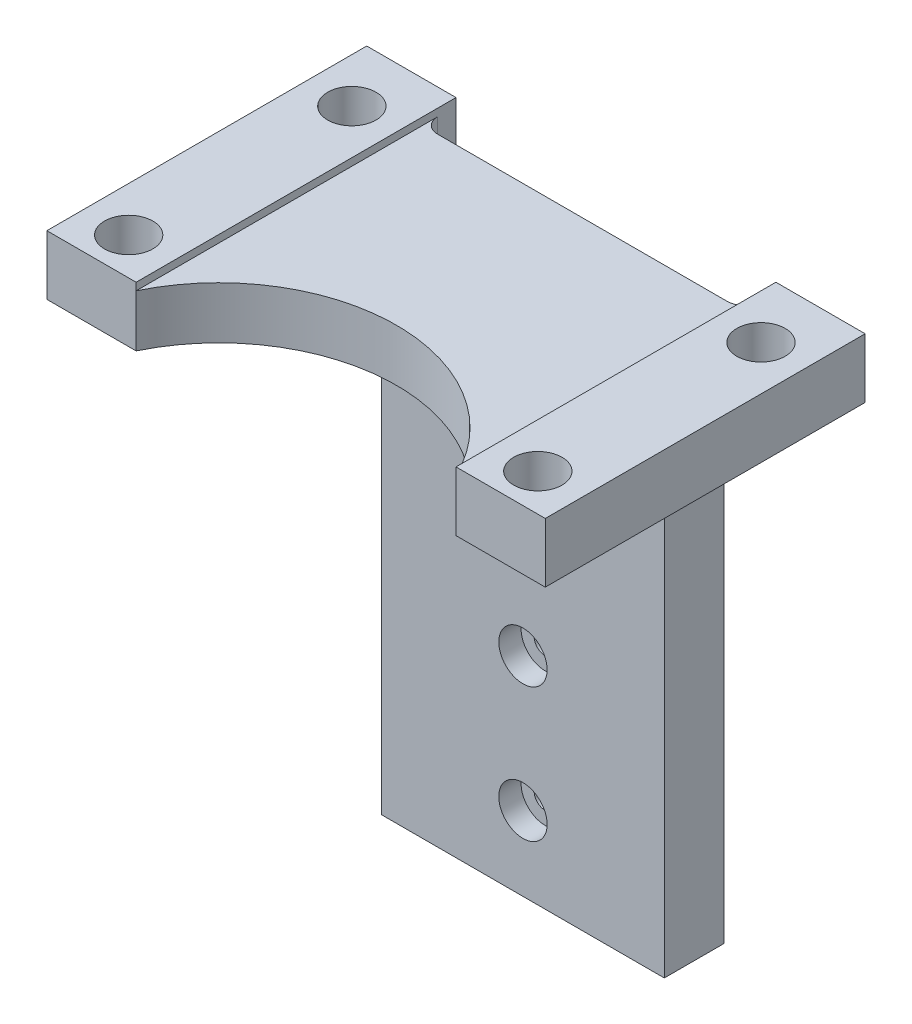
ISO-10303-21;
HEADER;
FILE_DESCRIPTION(('STEP AP214'),'2;1');
FILE_NAME('part.step','',(''),(''),'','','');
FILE_SCHEMA(('AUTOMOTIVE_DESIGN { 1 0 10303 214 1 1 1 1 }'));
ENDSEC;
DATA;
#1=APPLICATION_CONTEXT('core data for automotive mechanical design processes');
#2=APPLICATION_PROTOCOL_DEFINITION('international standard','automotive_design',2000,#1);
#3=PRODUCT_CONTEXT('',#1,'mechanical');
#4=PRODUCT('Part','Part','',(#3));
#5=PRODUCT_RELATED_PRODUCT_CATEGORY('part','',(#4));
#6=PRODUCT_DEFINITION_FORMATION('','',#4);
#7=PRODUCT_DEFINITION_CONTEXT('part definition',#1,'design');
#8=PRODUCT_DEFINITION('design','',#6,#7);
#9=PRODUCT_DEFINITION_SHAPE('','',#8);
#10=(LENGTH_UNIT() NAMED_UNIT(*) SI_UNIT(.MILLI.,.METRE.));
#11=(NAMED_UNIT(*) PLANE_ANGLE_UNIT() SI_UNIT($,.RADIAN.));
#12=(NAMED_UNIT(*) SI_UNIT($,.STERADIAN.) SOLID_ANGLE_UNIT());
#13=UNCERTAINTY_MEASURE_WITH_UNIT(LENGTH_MEASURE(1.E-05),#10,'distance_accuracy_value','');
#14=(GEOMETRIC_REPRESENTATION_CONTEXT(3) GLOBAL_UNCERTAINTY_ASSIGNED_CONTEXT((#13)) GLOBAL_UNIT_ASSIGNED_CONTEXT((#10,
#11,#12)) REPRESENTATION_CONTEXT('',''));
#15=CARTESIAN_POINT('',(0.,0.,0.));
#16=DIRECTION('',(0.,0.,1.));
#17=DIRECTION('',(1.,0.,0.));
#18=AXIS2_PLACEMENT_3D('',#15,#16,#17);
#19=CARTESIAN_POINT('',(14.,8.,-40.5));
#20=DIRECTION('',(0.,1.,0.));
#21=DIRECTION('',(0.,0.,1.));
#22=AXIS2_PLACEMENT_3D('',#19,#20,#21);
#23=PLANE('',#22);
#24=DIRECTION('',(0.,0.,1.));
#25=VECTOR('',#24,1.);
#26=CARTESIAN_POINT('',(55.,8.,-40.5));
#27=LINE('',#26,#25);
#28=CARTESIAN_POINT('',(55.,8.,-43.));
#29=VERTEX_POINT('',#28);
#30=CARTESIAN_POINT('',(55.,8.,0.));
#31=VERTEX_POINT('',#30);
#32=EDGE_CURVE('E158',#29,#31,#27,.T.);
#33=ORIENTED_EDGE('',*,*,#32,.T.);
#34=DIRECTION('',(1.,0.,0.));
#35=VECTOR('',#34,1.);
#36=CARTESIAN_POINT('',(55.,8.,0.));
#37=LINE('',#36,#35);
#38=CARTESIAN_POINT('',(67.,8.,0.));
#39=VERTEX_POINT('',#38);
#40=EDGE_CURVE('E168',#31,#39,#37,.T.);
#41=ORIENTED_EDGE('',*,*,#40,.T.);
#42=DIRECTION('',(0.,0.,-1.));
#43=VECTOR('',#42,1.);
#44=CARTESIAN_POINT('',(67.,8.,0.));
#45=LINE('',#44,#43);
#46=CARTESIAN_POINT('',(67.,8.,-43.));
#47=VERTEX_POINT('',#46);
#48=EDGE_CURVE('E200',#39,#47,#45,.T.);
#49=ORIENTED_EDGE('',*,*,#48,.T.);
#50=DIRECTION('',(-1.,0.,0.));
#51=VECTOR('',#50,1.);
#52=CARTESIAN_POINT('',(55.,8.,-43.));
#53=LINE('',#52,#51);
#54=EDGE_CURVE('E202',#47,#29,#53,.T.);
#55=ORIENTED_EDGE('',*,*,#54,.T.);
#56=EDGE_LOOP('',(#33,#41,#49,#55));
#57=FACE_BOUND('',#56,.T.);
#58=CARTESIAN_POINT('',(61.,8.,-35.));
#59=DIRECTION('',(0.,1.,0.));
#60=DIRECTION('',(0.,0.,1.));
#61=AXIS2_PLACEMENT_3D('',#58,#59,#60);
#62=CIRCLE('',#61,3.25);
#63=CARTESIAN_POINT('',(61.,8.,-31.75));
#64=VERTEX_POINT('',#63);
#65=EDGE_CURVE('E401',#64,#64,#62,.T.);
#66=ORIENTED_EDGE('',*,*,#65,.F.);
#67=EDGE_LOOP('',(#66));
#68=FACE_BOUND('',#67,.T.);
#69=CARTESIAN_POINT('',(61.,8.,-5.));
#70=DIRECTION('',(0.,1.,0.));
#71=DIRECTION('',(0.,0.,1.));
#72=AXIS2_PLACEMENT_3D('',#69,#70,#71);
#73=CIRCLE('',#72,3.25000000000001);
#74=CARTESIAN_POINT('',(61.,8.,-1.74999999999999));
#75=VERTEX_POINT('',#74);
#76=EDGE_CURVE('E393',#75,#75,#73,.T.);
#77=ORIENTED_EDGE('',*,*,#76,.F.);
#78=EDGE_LOOP('',(#77));
#79=FACE_BOUND('',#78,.T.);
#80=ADVANCED_FACE('F26',(#57,#68,#79),#23,.T.);
#81=CARTESIAN_POINT('',(14.,0.,-40.5));
#82=DIRECTION('',(0.,1.,0.));
#83=DIRECTION('',(0.,0.,1.));
#84=AXIS2_PLACEMENT_3D('',#81,#82,#83);
#85=PLANE('',#84);
#86=CARTESIAN_POINT('',(6.,0.,-35.));
#87=DIRECTION('',(0.,1.,0.));
#88=DIRECTION('',(0.,0.,1.));
#89=AXIS2_PLACEMENT_3D('',#86,#87,#88);
#90=CIRCLE('',#89,3.25);
#91=CARTESIAN_POINT('',(6.,0.,-31.75));
#92=VERTEX_POINT('',#91);
#93=EDGE_CURVE('E416',#92,#92,#90,.T.);
#94=ORIENTED_EDGE('',*,*,#93,.T.);
#95=EDGE_LOOP('',(#94));
#96=FACE_BOUND('',#95,.T.);
#97=CARTESIAN_POINT('',(61.,0.,-35.));
#98=DIRECTION('',(0.,1.,0.));
#99=DIRECTION('',(0.,0.,1.));
#100=AXIS2_PLACEMENT_3D('',#97,#98,#99);
#101=CIRCLE('',#100,3.25);
#102=CARTESIAN_POINT('',(61.,0.,-31.75));
#103=VERTEX_POINT('',#102);
#104=EDGE_CURVE('E404',#103,#103,#101,.T.);
#105=ORIENTED_EDGE('',*,*,#104,.T.);
#106=EDGE_LOOP('',(#105));
#107=FACE_BOUND('',#106,.T.);
#108=CARTESIAN_POINT('',(61.,0.,-5.));
#109=DIRECTION('',(0.,1.,0.));
#110=DIRECTION('',(0.,0.,1.));
#111=AXIS2_PLACEMENT_3D('',#108,#109,#110);
#112=CIRCLE('',#111,3.25000000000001);
#113=CARTESIAN_POINT('',(61.,0.,-1.74999999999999));
#114=VERTEX_POINT('',#113);
#115=EDGE_CURVE('E396',#114,#114,#112,.T.);
#116=ORIENTED_EDGE('',*,*,#115,.T.);
#117=EDGE_LOOP('',(#116));
#118=FACE_BOUND('',#117,.T.);
#119=CARTESIAN_POINT('',(6.,0.,-5.));
#120=DIRECTION('',(0.,1.,0.));
#121=DIRECTION('',(0.,0.,1.));
#122=AXIS2_PLACEMENT_3D('',#119,#120,#121);
#123=CIRCLE('',#122,3.25);
#124=CARTESIAN_POINT('',(6.,0.,-1.75));
#125=VERTEX_POINT('',#124);
#126=EDGE_CURVE('E410',#125,#125,#123,.T.);
#127=ORIENTED_EDGE('',*,*,#126,.T.);
#128=EDGE_LOOP('',(#127));
#129=FACE_BOUND('',#128,.T.);
#130=DIRECTION('',(0.,0.,1.));
#131=VECTOR('',#130,1.);
#132=CARTESIAN_POINT('',(52.5,0.,-38.5));
#133=LINE('',#132,#131);
#134=CARTESIAN_POINT('',(52.5,0.,-38.5));
#135=VERTEX_POINT('',#134);
#136=CARTESIAN_POINT('',(52.5,0.,-30.5));
#137=VERTEX_POINT('',#136);
#138=EDGE_CURVE('E330',#135,#137,#133,.T.);
#139=ORIENTED_EDGE('',*,*,#138,.F.);
#140=DIRECTION('',(-1.,0.,0.));
#141=VECTOR('',#140,1.);
#142=CARTESIAN_POINT('',(14.,0.,-38.5));
#143=LINE('',#142,#141);
#144=CARTESIAN_POINT('',(53.,0.,-38.5));
#145=VERTEX_POINT('',#144);
#146=EDGE_CURVE('E179',#145,#135,#143,.T.);
#147=ORIENTED_EDGE('',*,*,#146,.F.);
#148=CARTESIAN_POINT('',(53.,0.,-40.5));
#149=DIRECTION('',(0.,-1.,0.));
#150=DIRECTION('',(0.,0.,1.));
#151=AXIS2_PLACEMENT_3D('',#148,#149,#150);
#152=CIRCLE('',#151,2.);
#153=CARTESIAN_POINT('',(55.,0.,-40.5));
#154=VERTEX_POINT('',#153);
#155=EDGE_CURVE('E189',#154,#145,#152,.T.);
#156=ORIENTED_EDGE('',*,*,#155,.F.);
#157=DIRECTION('',(0.,0.,1.));
#158=VECTOR('',#157,1.);
#159=CARTESIAN_POINT('',(55.,0.,-40.5));
#160=LINE('',#159,#158);
#161=CARTESIAN_POINT('',(55.,0.,-43.));
#162=VERTEX_POINT('',#161);
#163=EDGE_CURVE('E264',#162,#154,#160,.T.);
#164=ORIENTED_EDGE('',*,*,#163,.F.);
#165=DIRECTION('',(-1.,0.,0.));
#166=VECTOR('',#165,1.);
#167=CARTESIAN_POINT('',(55.,0.,-43.));
#168=LINE('',#167,#166);
#169=CARTESIAN_POINT('',(67.,0.,-43.));
#170=VERTEX_POINT('',#169);
#171=EDGE_CURVE('E259',#170,#162,#168,.T.);
#172=ORIENTED_EDGE('',*,*,#171,.F.);
#173=DIRECTION('',(0.,0.,-1.));
#174=VECTOR('',#173,1.);
#175=CARTESIAN_POINT('',(67.,0.,0.));
#176=LINE('',#175,#174);
#177=CARTESIAN_POINT('',(67.,0.,0.));
#178=VERTEX_POINT('',#177);
#179=EDGE_CURVE('E257',#178,#170,#176,.T.);
#180=ORIENTED_EDGE('',*,*,#179,.F.);
#181=DIRECTION('',(1.,0.,0.));
#182=VECTOR('',#181,1.);
#183=CARTESIAN_POINT('',(55.,0.,0.));
#184=LINE('',#183,#182);
#185=CARTESIAN_POINT('',(55.,0.,0.));
#186=VERTEX_POINT('',#185);
#187=EDGE_CURVE('E252',#186,#178,#184,.T.);
#188=ORIENTED_EDGE('',*,*,#187,.F.);
#189=CARTESIAN_POINT('',(33.5,0.,10.3703703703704));
#190=DIRECTION('',(0.,-1.,0.));
#191=DIRECTION('',(0.,0.,-1.));
#192=AXIS2_PLACEMENT_3D('',#189,#190,#191);
#193=CIRCLE('',#192,23.8703703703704);
#194=CARTESIAN_POINT('',(12.,0.,0.));
#195=VERTEX_POINT('',#194);
#196=EDGE_CURVE('E250',#195,#186,#193,.T.);
#197=ORIENTED_EDGE('',*,*,#196,.F.);
#198=DIRECTION('',(1.,0.,0.));
#199=VECTOR('',#198,1.);
#200=CARTESIAN_POINT('',(0.,0.,0.));
#201=LINE('',#200,#199);
#202=CARTESIAN_POINT('',(0.,0.,0.));
#203=VERTEX_POINT('',#202);
#204=EDGE_CURVE('E253',#203,#195,#201,.T.);
#205=ORIENTED_EDGE('',*,*,#204,.F.);
#206=DIRECTION('',(0.,0.,1.));
#207=VECTOR('',#206,1.);
#208=CARTESIAN_POINT('',(0.,0.,0.));
#209=LINE('',#208,#207);
#210=CARTESIAN_POINT('',(0.,0.,-43.));
#211=VERTEX_POINT('',#210);
#212=EDGE_CURVE('E391',#211,#203,#209,.T.);
#213=ORIENTED_EDGE('',*,*,#212,.F.);
#214=DIRECTION('',(-1.,0.,0.));
#215=VECTOR('',#214,1.);
#216=CARTESIAN_POINT('',(0.,0.,-43.));
#217=LINE('',#216,#215);
#218=CARTESIAN_POINT('',(12.,0.,-43.));
#219=VERTEX_POINT('',#218);
#220=EDGE_CURVE('E196',#219,#211,#217,.T.);
#221=ORIENTED_EDGE('',*,*,#220,.F.);
#222=DIRECTION('',(0.,0.,-1.));
#223=VECTOR('',#222,1.);
#224=CARTESIAN_POINT('',(12.,0.,-43.));
#225=LINE('',#224,#223);
#226=CARTESIAN_POINT('',(12.,0.,-40.5));
#227=VERTEX_POINT('',#226);
#228=EDGE_CURVE('E194',#227,#219,#225,.T.);
#229=ORIENTED_EDGE('',*,*,#228,.F.);
#230=CARTESIAN_POINT('',(14.,0.,-40.5));
#231=DIRECTION('',(0.,-1.,0.));
#232=DIRECTION('',(0.,0.,1.));
#233=AXIS2_PLACEMENT_3D('',#230,#231,#232);
#234=CIRCLE('',#233,2.);
#235=CARTESIAN_POINT('',(14.,0.,-38.5));
#236=VERTEX_POINT('',#235);
#237=EDGE_CURVE('E183',#236,#227,#234,.T.);
#238=ORIENTED_EDGE('',*,*,#237,.F.);
#239=CARTESIAN_POINT('',(14.5,0.,-38.5));
#240=VERTEX_POINT('',#239);
#241=EDGE_CURVE('E184',#240,#236,#143,.T.);
#242=ORIENTED_EDGE('',*,*,#241,.F.);
#243=DIRECTION('',(0.,0.,-1.));
#244=VECTOR('',#243,1.);
#245=CARTESIAN_POINT('',(14.5,0.,-38.5));
#246=LINE('',#245,#244);
#247=CARTESIAN_POINT('',(14.5,0.,-30.5));
#248=VERTEX_POINT('',#247);
#249=EDGE_CURVE('E332',#248,#240,#246,.T.);
#250=ORIENTED_EDGE('',*,*,#249,.F.);
#251=DIRECTION('',(-1.,0.,0.));
#252=VECTOR('',#251,1.);
#253=CARTESIAN_POINT('',(52.5,0.,-30.5));
#254=LINE('',#253,#252);
#255=EDGE_CURVE('E51',#137,#248,#254,.T.);
#256=ORIENTED_EDGE('',*,*,#255,.F.);
#257=EDGE_LOOP('',(#139,#147,#156,#164,#172,#180,#188,#197,#205,#213,#221,#229,#238,#242,#250,#256));
#258=FACE_BOUND('',#257,.T.);
#259=ADVANCED_FACE('F255',(#96,#107,#118,#129,#258),#85,.F.);
#260=DIRECTION('',(1.,0.,0.));
#261=VECTOR('',#260,1.);
#262=CARTESIAN_POINT('',(0.,8.,0.));
#263=LINE('',#262,#261);
#264=CARTESIAN_POINT('',(0.,8.,0.));
#265=VERTEX_POINT('',#264);
#266=CARTESIAN_POINT('',(12.,8.,0.));
#267=VERTEX_POINT('',#266);
#268=EDGE_CURVE('E161',#265,#267,#263,.T.);
#269=ORIENTED_EDGE('',*,*,#268,.T.);
#270=DIRECTION('',(0.,0.,-1.));
#271=VECTOR('',#270,1.);
#272=CARTESIAN_POINT('',(12.,8.,-43.));
#273=LINE('',#272,#271);
#274=CARTESIAN_POINT('',(12.,8.,-43.));
#275=VERTEX_POINT('',#274);
#276=EDGE_CURVE('E147',#267,#275,#273,.T.);
#277=ORIENTED_EDGE('',*,*,#276,.T.);
#278=DIRECTION('',(-1.,0.,0.));
#279=VECTOR('',#278,1.);
#280=CARTESIAN_POINT('',(0.,8.,-43.));
#281=LINE('',#280,#279);
#282=CARTESIAN_POINT('',(0.,8.,-43.));
#283=VERTEX_POINT('',#282);
#284=EDGE_CURVE('E157',#275,#283,#281,.T.);
#285=ORIENTED_EDGE('',*,*,#284,.T.);
#286=DIRECTION('',(0.,0.,1.));
#287=VECTOR('',#286,1.);
#288=CARTESIAN_POINT('',(0.,8.,0.));
#289=LINE('',#288,#287);
#290=EDGE_CURVE('E165',#283,#265,#289,.T.);
#291=ORIENTED_EDGE('',*,*,#290,.T.);
#292=EDGE_LOOP('',(#269,#277,#285,#291));
#293=FACE_BOUND('',#292,.T.);
#294=CARTESIAN_POINT('',(6.,8.,-5.));
#295=DIRECTION('',(0.,1.,0.));
#296=DIRECTION('',(0.,0.,1.));
#297=AXIS2_PLACEMENT_3D('',#294,#295,#296);
#298=CIRCLE('',#297,3.25);
#299=CARTESIAN_POINT('',(6.,8.,-1.75));
#300=VERTEX_POINT('',#299);
#301=EDGE_CURVE('E407',#300,#300,#298,.T.);
#302=ORIENTED_EDGE('',*,*,#301,.F.);
#303=EDGE_LOOP('',(#302));
#304=FACE_BOUND('',#303,.T.);
#305=CARTESIAN_POINT('',(6.,8.,-35.));
#306=DIRECTION('',(0.,1.,0.));
#307=DIRECTION('',(0.,0.,1.));
#308=AXIS2_PLACEMENT_3D('',#305,#306,#307);
#309=CIRCLE('',#308,3.25);
#310=CARTESIAN_POINT('',(6.,8.,-31.75));
#311=VERTEX_POINT('',#310);
#312=EDGE_CURVE('E413',#311,#311,#309,.T.);
#313=ORIENTED_EDGE('',*,*,#312,.F.);
#314=EDGE_LOOP('',(#313));
#315=FACE_BOUND('',#314,.T.);
#316=ADVANCED_FACE('F162',(#293,#304,#315),#23,.T.);
#317=CARTESIAN_POINT('',(0.,8.,0.));
#318=DIRECTION('',(1.,0.,0.));
#319=DIRECTION('',(0.,0.,-1.));
#320=AXIS2_PLACEMENT_3D('',#317,#318,#319);
#321=PLANE('',#320);
#322=ORIENTED_EDGE('',*,*,#212,.T.);
#323=DIRECTION('',(0.,-1.,0.));
#324=VECTOR('',#323,1.);
#325=CARTESIAN_POINT('',(0.,8.,0.));
#326=LINE('',#325,#324);
#327=EDGE_CURVE('E11',#265,#203,#326,.T.);
#328=ORIENTED_EDGE('',*,*,#327,.F.);
#329=ORIENTED_EDGE('',*,*,#290,.F.);
#330=DIRECTION('',(0.,-1.,0.));
#331=VECTOR('',#330,1.);
#332=CARTESIAN_POINT('',(0.,8.,-43.));
#333=LINE('',#332,#331);
#334=EDGE_CURVE('E206',#283,#211,#333,.T.);
#335=ORIENTED_EDGE('',*,*,#334,.T.);
#336=EDGE_LOOP('',(#322,#328,#329,#335));
#337=FACE_BOUND('',#336,.T.);
#338=ADVANCED_FACE('F28',(#337),#321,.F.);
#339=CARTESIAN_POINT('',(0.,8.,0.));
#340=DIRECTION('',(0.,0.,-1.));
#341=DIRECTION('',(-1.,0.,0.));
#342=AXIS2_PLACEMENT_3D('',#339,#340,#341);
#343=PLANE('',#342);
#344=ORIENTED_EDGE('',*,*,#204,.T.);
#345=DIRECTION('',(0.,-1.,0.));
#346=VECTOR('',#345,1.);
#347=CARTESIAN_POINT('',(12.,8.,0.));
#348=LINE('',#347,#346);
#349=CARTESIAN_POINT('',(12.,7.,0.));
#350=VERTEX_POINT('',#349);
#351=EDGE_CURVE('E173',#350,#195,#348,.T.);
#352=ORIENTED_EDGE('',*,*,#351,.F.);
#353=EDGE_CURVE('E35',#267,#350,#348,.T.);
#354=ORIENTED_EDGE('',*,*,#353,.F.);
#355=ORIENTED_EDGE('',*,*,#268,.F.);
#356=ORIENTED_EDGE('',*,*,#327,.T.);
#357=EDGE_LOOP('',(#344,#352,#354,#355,#356));
#358=FACE_BOUND('',#357,.T.);
#359=ADVANCED_FACE('F172',(#358),#343,.F.);
#360=CARTESIAN_POINT('',(33.5,8.,10.3703703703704));
#361=DIRECTION('',(0.,-1.,0.));
#362=DIRECTION('',(0.,0.,-1.));
#363=AXIS2_PLACEMENT_3D('',#360,#361,#362);
#364=CYLINDRICAL_SURFACE('',#363,23.8703703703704);
#365=DIRECTION('',(0.,-1.,0.));
#366=VECTOR('',#365,1.);
#367=CARTESIAN_POINT('',(55.,8.,0.));
#368=LINE('',#367,#366);
#369=CARTESIAN_POINT('',(55.,7.,0.));
#370=VERTEX_POINT('',#369);
#371=EDGE_CURVE('E224',#370,#186,#368,.T.);
#372=ORIENTED_EDGE('',*,*,#371,.F.);
#373=CARTESIAN_POINT('',(33.5,7.,10.3703703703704));
#374=DIRECTION('',(0.,-1.,0.));
#375=DIRECTION('',(0.,0.,-1.));
#376=AXIS2_PLACEMENT_3D('',#373,#374,#375);
#377=CIRCLE('',#376,23.8703703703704);
#378=EDGE_CURVE('E248',#370,#350,#377,.F.);
#379=ORIENTED_EDGE('',*,*,#378,.T.);
#380=ORIENTED_EDGE('',*,*,#351,.T.);
#381=ORIENTED_EDGE('',*,*,#196,.T.);
#382=EDGE_LOOP('',(#372,#379,#380,#381));
#383=FACE_BOUND('',#382,.T.);
#384=ADVANCED_FACE('F247',(#383),#364,.F.);
#385=CARTESIAN_POINT('',(55.,8.,0.));
#386=DIRECTION('',(0.,0.,-1.));
#387=DIRECTION('',(-1.,0.,0.));
#388=AXIS2_PLACEMENT_3D('',#385,#386,#387);
#389=PLANE('',#388);
#390=ORIENTED_EDGE('',*,*,#187,.T.);
#391=DIRECTION('',(0.,-1.,0.));
#392=VECTOR('',#391,1.);
#393=CARTESIAN_POINT('',(67.,8.,0.));
#394=LINE('',#393,#392);
#395=EDGE_CURVE('E222',#39,#178,#394,.T.);
#396=ORIENTED_EDGE('',*,*,#395,.F.);
#397=ORIENTED_EDGE('',*,*,#40,.F.);
#398=EDGE_CURVE('E175',#31,#370,#368,.T.);
#399=ORIENTED_EDGE('',*,*,#398,.T.);
#400=ORIENTED_EDGE('',*,*,#371,.T.);
#401=EDGE_LOOP('',(#390,#396,#397,#399,#400));
#402=FACE_BOUND('',#401,.T.);
#403=ADVANCED_FACE('F235',(#402),#389,.F.);
#404=CARTESIAN_POINT('',(67.,8.,0.));
#405=DIRECTION('',(-1.,0.,0.));
#406=DIRECTION('',(0.,0.,1.));
#407=AXIS2_PLACEMENT_3D('',#404,#405,#406);
#408=PLANE('',#407);
#409=ORIENTED_EDGE('',*,*,#179,.T.);
#410=DIRECTION('',(0.,-1.,0.));
#411=VECTOR('',#410,1.);
#412=CARTESIAN_POINT('',(67.,8.,-43.));
#413=LINE('',#412,#411);
#414=EDGE_CURVE('E220',#47,#170,#413,.T.);
#415=ORIENTED_EDGE('',*,*,#414,.F.);
#416=ORIENTED_EDGE('',*,*,#48,.F.);
#417=ORIENTED_EDGE('',*,*,#395,.T.);
#418=EDGE_LOOP('',(#409,#415,#416,#417));
#419=FACE_BOUND('',#418,.T.);
#420=ADVANCED_FACE('F489',(#419),#408,.F.);
#421=CARTESIAN_POINT('',(55.,8.,-43.));
#422=DIRECTION('',(0.,0.,1.));
#423=DIRECTION('',(1.,0.,0.));
#424=AXIS2_PLACEMENT_3D('',#421,#422,#423);
#425=PLANE('',#424);
#426=ORIENTED_EDGE('',*,*,#171,.T.);
#427=DIRECTION('',(0.,-1.,0.));
#428=VECTOR('',#427,1.);
#429=CARTESIAN_POINT('',(55.,8.,-43.));
#430=LINE('',#429,#428);
#431=EDGE_CURVE('E218',#29,#162,#430,.T.);
#432=ORIENTED_EDGE('',*,*,#431,.F.);
#433=ORIENTED_EDGE('',*,*,#54,.F.);
#434=ORIENTED_EDGE('',*,*,#414,.T.);
#435=EDGE_LOOP('',(#426,#432,#433,#434));
#436=FACE_BOUND('',#435,.T.);
#437=ADVANCED_FACE('F486',(#436),#425,.F.);
#438=CARTESIAN_POINT('',(55.,8.,-40.5));
#439=DIRECTION('',(1.,0.,0.));
#440=DIRECTION('',(0.,0.,-1.));
#441=AXIS2_PLACEMENT_3D('',#438,#439,#440);
#442=PLANE('',#441);
#443=DIRECTION('',(0.,-1.,0.));
#444=VECTOR('',#443,1.);
#445=CARTESIAN_POINT('',(55.,8.,-40.5));
#446=LINE('',#445,#444);
#447=CARTESIAN_POINT('',(55.,7.,-40.5));
#448=VERTEX_POINT('',#447);
#449=EDGE_CURVE('E216',#448,#154,#446,.T.);
#450=ORIENTED_EDGE('',*,*,#449,.F.);
#451=DIRECTION('',(0.,0.,-1.));
#452=VECTOR('',#451,1.);
#453=CARTESIAN_POINT('',(55.,7.,-43.));
#454=LINE('',#453,#452);
#455=EDGE_CURVE('E241',#370,#448,#454,.T.);
#456=ORIENTED_EDGE('',*,*,#455,.F.);
#457=ORIENTED_EDGE('',*,*,#398,.F.);
#458=ORIENTED_EDGE('',*,*,#32,.F.);
#459=ORIENTED_EDGE('',*,*,#431,.T.);
#460=ORIENTED_EDGE('',*,*,#163,.T.);
#461=EDGE_LOOP('',(#450,#456,#457,#458,#459,#460));
#462=FACE_BOUND('',#461,.T.);
#463=ADVANCED_FACE('F240',(#462),#442,.F.);
#464=CARTESIAN_POINT('',(53.,8.,-40.5));
#465=DIRECTION('',(0.,-1.,0.));
#466=DIRECTION('',(0.,0.,-1.));
#467=AXIS2_PLACEMENT_3D('',#464,#465,#466);
#468=CYLINDRICAL_SURFACE('',#467,2.);
#469=DIRECTION('',(0.,-1.,0.));
#470=VECTOR('',#469,1.);
#471=CARTESIAN_POINT('',(53.,8.,-38.5));
#472=LINE('',#471,#470);
#473=CARTESIAN_POINT('',(53.,7.,-38.5));
#474=VERTEX_POINT('',#473);
#475=EDGE_CURVE('E214',#474,#145,#472,.T.);
#476=ORIENTED_EDGE('',*,*,#475,.F.);
#477=CARTESIAN_POINT('',(53.,7.,-40.5));
#478=DIRECTION('',(0.,-1.,0.));
#479=DIRECTION('',(0.,0.,-1.));
#480=AXIS2_PLACEMENT_3D('',#477,#478,#479);
#481=CIRCLE('',#480,2.);
#482=EDGE_CURVE('E288',#474,#448,#481,.F.);
#483=ORIENTED_EDGE('',*,*,#482,.T.);
#484=ORIENTED_EDGE('',*,*,#449,.T.);
#485=ORIENTED_EDGE('',*,*,#155,.T.);
#486=EDGE_LOOP('',(#476,#483,#484,#485));
#487=FACE_BOUND('',#486,.T.);
#488=ADVANCED_FACE('F358',(#487),#468,.F.);
#489=CARTESIAN_POINT('',(14.,8.,-38.5));
#490=DIRECTION('',(0.,0.,1.));
#491=DIRECTION('',(1.,0.,0.));
#492=AXIS2_PLACEMENT_3D('',#489,#490,#491);
#493=PLANE('',#492);
#494=CARTESIAN_POINT('',(33.4999999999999,-22.,-38.5));
#495=DIRECTION('',(0.,0.,1.));
#496=DIRECTION('',(1.,0.,0.));
#497=AXIS2_PLACEMENT_3D('',#494,#495,#496);
#498=CIRCLE('',#497,1.5);
#499=CARTESIAN_POINT('',(34.9999999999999,-22.,-38.5));
#500=VERTEX_POINT('',#499);
#501=EDGE_CURVE('E297',#500,#500,#498,.T.);
#502=ORIENTED_EDGE('',*,*,#501,.T.);
#503=EDGE_LOOP('',(#502));
#504=FACE_BOUND('',#503,.T.);
#505=CARTESIAN_POINT('',(33.4999999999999,-40.,-38.5));
#506=DIRECTION('',(0.,0.,1.));
#507=DIRECTION('',(1.,0.,0.));
#508=AXIS2_PLACEMENT_3D('',#505,#506,#507);
#509=CIRCLE('',#508,1.5);
#510=CARTESIAN_POINT('',(34.9999999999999,-40.,-38.5));
#511=VERTEX_POINT('',#510);
#512=EDGE_CURVE('E303',#511,#511,#509,.T.);
#513=ORIENTED_EDGE('',*,*,#512,.T.);
#514=EDGE_LOOP('',(#513));
#515=FACE_BOUND('',#514,.T.);
#516=CARTESIAN_POINT('',(33.5,-58.,-38.5));
#517=DIRECTION('',(0.,0.,1.));
#518=DIRECTION('',(1.,0.,0.));
#519=AXIS2_PLACEMENT_3D('',#516,#517,#518);
#520=CIRCLE('',#519,1.5);
#521=CARTESIAN_POINT('',(35.,-58.,-38.5));
#522=VERTEX_POINT('',#521);
#523=EDGE_CURVE('E309',#522,#522,#520,.T.);
#524=ORIENTED_EDGE('',*,*,#523,.T.);
#525=EDGE_LOOP('',(#524));
#526=FACE_BOUND('',#525,.T.);
#527=DIRECTION('',(0.,-1.,0.));
#528=VECTOR('',#527,1.);
#529=CARTESIAN_POINT('',(14.,8.,-38.5));
#530=LINE('',#529,#528);
#531=CARTESIAN_POINT('',(14.,7.,-38.5));
#532=VERTEX_POINT('',#531);
#533=EDGE_CURVE('E212',#532,#236,#530,.T.);
#534=ORIENTED_EDGE('',*,*,#533,.F.);
#535=DIRECTION('',(1.,0.,0.));
#536=VECTOR('',#535,1.);
#537=CARTESIAN_POINT('',(14.,7.,-38.5));
#538=LINE('',#537,#536);
#539=EDGE_CURVE('E43',#532,#474,#538,.T.);
#540=ORIENTED_EDGE('',*,*,#539,.T.);
#541=ORIENTED_EDGE('',*,*,#475,.T.);
#542=ORIENTED_EDGE('',*,*,#146,.T.);
#543=DIRECTION('',(0.,1.,0.));
#544=VECTOR('',#543,1.);
#545=CARTESIAN_POINT('',(52.5,-68.,-38.5));
#546=LINE('',#545,#544);
#547=CARTESIAN_POINT('',(52.5,-68.,-38.5));
#548=VERTEX_POINT('',#547);
#549=EDGE_CURVE('E342',#548,#135,#546,.T.);
#550=ORIENTED_EDGE('',*,*,#549,.F.);
#551=DIRECTION('',(1.,0.,0.));
#552=VECTOR('',#551,1.);
#553=CARTESIAN_POINT('',(52.5,-68.,-38.5));
#554=LINE('',#553,#552);
#555=CARTESIAN_POINT('',(14.5,-68.,-38.5));
#556=VERTEX_POINT('',#555);
#557=EDGE_CURVE('E347',#556,#548,#554,.T.);
#558=ORIENTED_EDGE('',*,*,#557,.F.);
#559=DIRECTION('',(0.,1.,0.));
#560=VECTOR('',#559,1.);
#561=CARTESIAN_POINT('',(14.5,-68.,-38.5));
#562=LINE('',#561,#560);
#563=EDGE_CURVE('E279',#556,#240,#562,.T.);
#564=ORIENTED_EDGE('',*,*,#563,.T.);
#565=ORIENTED_EDGE('',*,*,#241,.T.);
#566=EDGE_LOOP('',(#534,#540,#541,#542,#550,#558,#564,#565));
#567=FACE_BOUND('',#566,.T.);
#568=ADVANCED_FACE('F276',(#504,#515,#526,#567),#493,.F.);
#569=CARTESIAN_POINT('',(14.,8.,-40.5));
#570=DIRECTION('',(0.,-1.,0.));
#571=DIRECTION('',(0.,0.,-1.));
#572=AXIS2_PLACEMENT_3D('',#569,#570,#571);
#573=CYLINDRICAL_SURFACE('',#572,2.);
#574=DIRECTION('',(0.,-1.,0.));
#575=VECTOR('',#574,1.);
#576=CARTESIAN_POINT('',(12.,8.,-40.5));
#577=LINE('',#576,#575);
#578=CARTESIAN_POINT('',(12.,7.,-40.5));
#579=VERTEX_POINT('',#578);
#580=EDGE_CURVE('E210',#579,#227,#577,.T.);
#581=ORIENTED_EDGE('',*,*,#580,.F.);
#582=CARTESIAN_POINT('',(14.,7.,-40.5));
#583=DIRECTION('',(0.,-1.,0.));
#584=DIRECTION('',(0.,0.,-1.));
#585=AXIS2_PLACEMENT_3D('',#582,#583,#584);
#586=CIRCLE('',#585,2.);
#587=EDGE_CURVE('E286',#579,#532,#586,.F.);
#588=ORIENTED_EDGE('',*,*,#587,.T.);
#589=ORIENTED_EDGE('',*,*,#533,.T.);
#590=ORIENTED_EDGE('',*,*,#237,.T.);
#591=EDGE_LOOP('',(#581,#588,#589,#590));
#592=FACE_BOUND('',#591,.T.);
#593=ADVANCED_FACE('F285',(#592),#573,.F.);
#594=CARTESIAN_POINT('',(12.,8.,-43.));
#595=DIRECTION('',(-1.,0.,0.));
#596=DIRECTION('',(0.,0.,1.));
#597=AXIS2_PLACEMENT_3D('',#594,#595,#596);
#598=PLANE('',#597);
#599=ORIENTED_EDGE('',*,*,#228,.T.);
#600=DIRECTION('',(0.,-1.,0.));
#601=VECTOR('',#600,1.);
#602=CARTESIAN_POINT('',(12.,8.,-43.));
#603=LINE('',#602,#601);
#604=EDGE_CURVE('E154',#275,#219,#603,.T.);
#605=ORIENTED_EDGE('',*,*,#604,.F.);
#606=ORIENTED_EDGE('',*,*,#276,.F.);
#607=ORIENTED_EDGE('',*,*,#353,.T.);
#608=DIRECTION('',(0.,0.,1.));
#609=VECTOR('',#608,1.);
#610=CARTESIAN_POINT('',(12.,7.,-43.));
#611=LINE('',#610,#609);
#612=EDGE_CURVE('E244',#579,#350,#611,.T.);
#613=ORIENTED_EDGE('',*,*,#612,.F.);
#614=ORIENTED_EDGE('',*,*,#580,.T.);
#615=EDGE_LOOP('',(#599,#605,#606,#607,#613,#614));
#616=FACE_BOUND('',#615,.T.);
#617=ADVANCED_FACE('F150',(#616),#598,.F.);
#618=CARTESIAN_POINT('',(0.,8.,-43.));
#619=DIRECTION('',(0.,0.,1.));
#620=DIRECTION('',(1.,0.,0.));
#621=AXIS2_PLACEMENT_3D('',#618,#619,#620);
#622=PLANE('',#621);
#623=ORIENTED_EDGE('',*,*,#220,.T.);
#624=ORIENTED_EDGE('',*,*,#334,.F.);
#625=ORIENTED_EDGE('',*,*,#284,.F.);
#626=ORIENTED_EDGE('',*,*,#604,.T.);
#627=EDGE_LOOP('',(#623,#624,#625,#626));
#628=FACE_BOUND('',#627,.T.);
#629=ADVANCED_FACE('F459',(#628),#622,.F.);
#630=CARTESIAN_POINT('',(61.,8.,-5.));
#631=DIRECTION('',(0.,-1.,0.));
#632=DIRECTION('',(0.,0.,-1.));
#633=AXIS2_PLACEMENT_3D('',#630,#631,#632);
#634=CYLINDRICAL_SURFACE('',#633,3.25000000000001);
#635=ORIENTED_EDGE('',*,*,#76,.T.);
#636=EDGE_LOOP('',(#635));
#637=FACE_BOUND('',#636,.T.);
#638=ORIENTED_EDGE('',*,*,#115,.F.);
#639=EDGE_LOOP('',(#638));
#640=FACE_BOUND('',#639,.T.);
#641=ADVANCED_FACE('F456',(#637,#640),#634,.F.);
#642=CARTESIAN_POINT('',(61.,8.,-35.));
#643=DIRECTION('',(0.,-1.,0.));
#644=DIRECTION('',(0.,0.,-1.));
#645=AXIS2_PLACEMENT_3D('',#642,#643,#644);
#646=CYLINDRICAL_SURFACE('',#645,3.25);
#647=ORIENTED_EDGE('',*,*,#65,.T.);
#648=EDGE_LOOP('',(#647));
#649=FACE_BOUND('',#648,.T.);
#650=ORIENTED_EDGE('',*,*,#104,.F.);
#651=EDGE_LOOP('',(#650));
#652=FACE_BOUND('',#651,.T.);
#653=ADVANCED_FACE('F452',(#649,#652),#646,.F.);
#654=CARTESIAN_POINT('',(6.,8.,-5.));
#655=DIRECTION('',(0.,-1.,0.));
#656=DIRECTION('',(0.,0.,-1.));
#657=AXIS2_PLACEMENT_3D('',#654,#655,#656);
#658=CYLINDRICAL_SURFACE('',#657,3.25);
#659=ORIENTED_EDGE('',*,*,#301,.T.);
#660=EDGE_LOOP('',(#659));
#661=FACE_BOUND('',#660,.T.);
#662=ORIENTED_EDGE('',*,*,#126,.F.);
#663=EDGE_LOOP('',(#662));
#664=FACE_BOUND('',#663,.T.);
#665=ADVANCED_FACE('F448',(#661,#664),#658,.F.);
#666=CARTESIAN_POINT('',(6.,8.,-35.));
#667=DIRECTION('',(0.,-1.,0.));
#668=DIRECTION('',(0.,0.,-1.));
#669=AXIS2_PLACEMENT_3D('',#666,#667,#668);
#670=CYLINDRICAL_SURFACE('',#669,3.25);
#671=ORIENTED_EDGE('',*,*,#312,.T.);
#672=EDGE_LOOP('',(#671));
#673=FACE_BOUND('',#672,.T.);
#674=ORIENTED_EDGE('',*,*,#93,.F.);
#675=EDGE_LOOP('',(#674));
#676=FACE_BOUND('',#675,.T.);
#677=ADVANCED_FACE('F440',(#673,#676),#670,.F.);
#678=CARTESIAN_POINT('',(52.5,-68.,-38.5));
#679=DIRECTION('',(-1.,0.,0.));
#680=DIRECTION('',(0.,0.,1.));
#681=AXIS2_PLACEMENT_3D('',#678,#679,#680);
#682=PLANE('',#681);
#683=ORIENTED_EDGE('',*,*,#138,.T.);
#684=DIRECTION('',(0.,1.,0.));
#685=VECTOR('',#684,1.);
#686=CARTESIAN_POINT('',(52.5,-68.,-30.5));
#687=LINE('',#686,#685);
#688=CARTESIAN_POINT('',(52.5,-68.,-30.5));
#689=VERTEX_POINT('',#688);
#690=EDGE_CURVE('E344',#689,#137,#687,.T.);
#691=ORIENTED_EDGE('',*,*,#690,.F.);
#692=DIRECTION('',(0.,0.,1.));
#693=VECTOR('',#692,1.);
#694=CARTESIAN_POINT('',(52.5,-68.,-38.5));
#695=LINE('',#694,#693);
#696=EDGE_CURVE('E335',#548,#689,#695,.T.);
#697=ORIENTED_EDGE('',*,*,#696,.F.);
#698=ORIENTED_EDGE('',*,*,#549,.T.);
#699=EDGE_LOOP('',(#683,#691,#697,#698));
#700=FACE_BOUND('',#699,.T.);
#701=ADVANCED_FACE('F357',(#700),#682,.F.);
#702=CARTESIAN_POINT('',(52.5,-68.,-30.5));
#703=DIRECTION('',(0.,0.,-1.));
#704=DIRECTION('',(-1.,0.,0.));
#705=AXIS2_PLACEMENT_3D('',#702,#703,#704);
#706=PLANE('',#705);
#707=CARTESIAN_POINT('',(33.4999999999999,-22.,-30.5));
#708=DIRECTION('',(0.,0.,1.));
#709=DIRECTION('',(1.,0.,0.));
#710=AXIS2_PLACEMENT_3D('',#707,#708,#709);
#711=CIRCLE('',#710,3.25);
#712=CARTESIAN_POINT('',(36.7499999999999,-22.,-30.5));
#713=VERTEX_POINT('',#712);
#714=EDGE_CURVE('E312',#713,#713,#711,.T.);
#715=ORIENTED_EDGE('',*,*,#714,.F.);
#716=EDGE_LOOP('',(#715));
#717=FACE_BOUND('',#716,.T.);
#718=CARTESIAN_POINT('',(33.4999999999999,-40.,-30.5));
#719=DIRECTION('',(0.,0.,1.));
#720=DIRECTION('',(1.,0.,0.));
#721=AXIS2_PLACEMENT_3D('',#718,#719,#720);
#722=CIRCLE('',#721,3.25);
#723=CARTESIAN_POINT('',(36.7499999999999,-40.,-30.5));
#724=VERTEX_POINT('',#723);
#725=EDGE_CURVE('E318',#724,#724,#722,.T.);
#726=ORIENTED_EDGE('',*,*,#725,.F.);
#727=EDGE_LOOP('',(#726));
#728=FACE_BOUND('',#727,.T.);
#729=CARTESIAN_POINT('',(33.5,-58.,-30.5));
#730=DIRECTION('',(0.,0.,1.));
#731=DIRECTION('',(1.,0.,0.));
#732=AXIS2_PLACEMENT_3D('',#729,#730,#731);
#733=CIRCLE('',#732,3.25);
#734=CARTESIAN_POINT('',(36.75,-58.,-30.5));
#735=VERTEX_POINT('',#734);
#736=EDGE_CURVE('E324',#735,#735,#733,.T.);
#737=ORIENTED_EDGE('',*,*,#736,.F.);
#738=EDGE_LOOP('',(#737));
#739=FACE_BOUND('',#738,.T.);
#740=ORIENTED_EDGE('',*,*,#255,.T.);
#741=DIRECTION('',(0.,1.,0.));
#742=VECTOR('',#741,1.);
#743=CARTESIAN_POINT('',(14.5,-68.,-30.5));
#744=LINE('',#743,#742);
#745=CARTESIAN_POINT('',(14.5,-68.,-30.5));
#746=VERTEX_POINT('',#745);
#747=EDGE_CURVE('E341',#746,#248,#744,.T.);
#748=ORIENTED_EDGE('',*,*,#747,.F.);
#749=DIRECTION('',(-1.,0.,0.));
#750=VECTOR('',#749,1.);
#751=CARTESIAN_POINT('',(52.5,-68.,-30.5));
#752=LINE('',#751,#750);
#753=EDGE_CURVE('E420',#689,#746,#752,.T.);
#754=ORIENTED_EDGE('',*,*,#753,.F.);
#755=ORIENTED_EDGE('',*,*,#690,.T.);
#756=EDGE_LOOP('',(#740,#748,#754,#755));
#757=FACE_BOUND('',#756,.T.);
#758=ADVANCED_FACE('F429',(#717,#728,#739,#757),#706,.F.);
#759=CARTESIAN_POINT('',(14.5,-68.,-38.5));
#760=DIRECTION('',(1.,0.,0.));
#761=DIRECTION('',(0.,0.,-1.));
#762=AXIS2_PLACEMENT_3D('',#759,#760,#761);
#763=PLANE('',#762);
#764=ORIENTED_EDGE('',*,*,#249,.T.);
#765=ORIENTED_EDGE('',*,*,#563,.F.);
#766=DIRECTION('',(0.,0.,-1.));
#767=VECTOR('',#766,1.);
#768=CARTESIAN_POINT('',(14.5,-68.,-38.5));
#769=LINE('',#768,#767);
#770=EDGE_CURVE('E352',#746,#556,#769,.T.);
#771=ORIENTED_EDGE('',*,*,#770,.F.);
#772=ORIENTED_EDGE('',*,*,#747,.T.);
#773=EDGE_LOOP('',(#764,#765,#771,#772));
#774=FACE_BOUND('',#773,.T.);
#775=ADVANCED_FACE('F427',(#774),#763,.F.);
#776=CARTESIAN_POINT('',(52.5,-68.,-30.5));
#777=DIRECTION('',(0.,-1.,0.));
#778=DIRECTION('',(0.,0.,-1.));
#779=AXIS2_PLACEMENT_3D('',#776,#777,#778);
#780=PLANE('',#779);
#781=ORIENTED_EDGE('',*,*,#696,.T.);
#782=ORIENTED_EDGE('',*,*,#753,.T.);
#783=ORIENTED_EDGE('',*,*,#770,.T.);
#784=ORIENTED_EDGE('',*,*,#557,.T.);
#785=EDGE_LOOP('',(#781,#782,#783,#784));
#786=FACE_BOUND('',#785,.T.);
#787=ADVANCED_FACE('F424',(#786),#780,.T.);
#788=CARTESIAN_POINT('',(33.5,-58.,-33.5));
#789=DIRECTION('',(0.,0.,1.));
#790=DIRECTION('',(1.,0.,0.));
#791=AXIS2_PLACEMENT_3D('',#788,#789,#790);
#792=CYLINDRICAL_SURFACE('',#791,3.25);
#793=CARTESIAN_POINT('',(33.5,-58.,-33.5));
#794=DIRECTION('',(0.,0.,1.));
#795=DIRECTION('',(1.,0.,0.));
#796=AXIS2_PLACEMENT_3D('',#793,#794,#795);
#797=CIRCLE('',#796,3.25);
#798=CARTESIAN_POINT('',(36.75,-58.,-33.5));
#799=VERTEX_POINT('',#798);
#800=EDGE_CURVE('E327',#799,#799,#797,.T.);
#801=ORIENTED_EDGE('',*,*,#800,.F.);
#802=EDGE_LOOP('',(#801));
#803=FACE_BOUND('',#802,.T.);
#804=ORIENTED_EDGE('',*,*,#736,.T.);
#805=EDGE_LOOP('',(#804));
#806=FACE_BOUND('',#805,.T.);
#807=ADVANCED_FACE('F567',(#803,#806),#792,.F.);
#808=CARTESIAN_POINT('',(33.5,-58.,-33.5));
#809=DIRECTION('',(0.,0.,1.));
#810=DIRECTION('',(1.,0.,0.));
#811=AXIS2_PLACEMENT_3D('',#808,#809,#810);
#812=PLANE('',#811);
#813=CARTESIAN_POINT('',(33.5,-58.,-33.5));
#814=DIRECTION('',(0.,0.,1.));
#815=DIRECTION('',(1.,0.,0.));
#816=AXIS2_PLACEMENT_3D('',#813,#814,#815);
#817=CIRCLE('',#816,1.5);
#818=CARTESIAN_POINT('',(35.,-58.,-33.5));
#819=VERTEX_POINT('',#818);
#820=EDGE_CURVE('E306',#819,#819,#817,.T.);
#821=ORIENTED_EDGE('',*,*,#820,.F.);
#822=EDGE_LOOP('',(#821));
#823=FACE_BOUND('',#822,.T.);
#824=ORIENTED_EDGE('',*,*,#800,.T.);
#825=EDGE_LOOP('',(#824));
#826=FACE_BOUND('',#825,.T.);
#827=ADVANCED_FACE('F574',(#823,#826),#812,.T.);
#828=CARTESIAN_POINT('',(33.4999999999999,-40.,-33.5));
#829=DIRECTION('',(0.,0.,1.));
#830=DIRECTION('',(1.,0.,0.));
#831=AXIS2_PLACEMENT_3D('',#828,#829,#830);
#832=CYLINDRICAL_SURFACE('',#831,3.25);
#833=CARTESIAN_POINT('',(33.4999999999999,-40.,-33.5));
#834=DIRECTION('',(0.,0.,1.));
#835=DIRECTION('',(1.,0.,0.));
#836=AXIS2_PLACEMENT_3D('',#833,#834,#835);
#837=CIRCLE('',#836,3.25);
#838=CARTESIAN_POINT('',(36.7499999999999,-40.,-33.5));
#839=VERTEX_POINT('',#838);
#840=EDGE_CURVE('E321',#839,#839,#837,.T.);
#841=ORIENTED_EDGE('',*,*,#840,.F.);
#842=EDGE_LOOP('',(#841));
#843=FACE_BOUND('',#842,.T.);
#844=ORIENTED_EDGE('',*,*,#725,.T.);
#845=EDGE_LOOP('',(#844));
#846=FACE_BOUND('',#845,.T.);
#847=ADVANCED_FACE('F583',(#843,#846),#832,.F.);
#848=CARTESIAN_POINT('',(33.4999999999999,-40.,-33.5));
#849=DIRECTION('',(0.,0.,1.));
#850=DIRECTION('',(1.,0.,0.));
#851=AXIS2_PLACEMENT_3D('',#848,#849,#850);
#852=PLANE('',#851);
#853=CARTESIAN_POINT('',(33.4999999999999,-40.,-33.5));
#854=DIRECTION('',(0.,0.,1.));
#855=DIRECTION('',(1.,0.,0.));
#856=AXIS2_PLACEMENT_3D('',#853,#854,#855);
#857=CIRCLE('',#856,1.5);
#858=CARTESIAN_POINT('',(34.9999999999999,-40.,-33.5));
#859=VERTEX_POINT('',#858);
#860=EDGE_CURVE('E300',#859,#859,#857,.T.);
#861=ORIENTED_EDGE('',*,*,#860,.F.);
#862=EDGE_LOOP('',(#861));
#863=FACE_BOUND('',#862,.T.);
#864=ORIENTED_EDGE('',*,*,#840,.T.);
#865=EDGE_LOOP('',(#864));
#866=FACE_BOUND('',#865,.T.);
#867=ADVANCED_FACE('F592',(#863,#866),#852,.T.);
#868=CARTESIAN_POINT('',(33.4999999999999,-22.,-33.5));
#869=DIRECTION('',(0.,0.,1.));
#870=DIRECTION('',(1.,0.,0.));
#871=AXIS2_PLACEMENT_3D('',#868,#869,#870);
#872=CYLINDRICAL_SURFACE('',#871,3.25);
#873=CARTESIAN_POINT('',(33.4999999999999,-22.,-33.5));
#874=DIRECTION('',(0.,0.,1.));
#875=DIRECTION('',(1.,0.,0.));
#876=AXIS2_PLACEMENT_3D('',#873,#874,#875);
#877=CIRCLE('',#876,3.25);
#878=CARTESIAN_POINT('',(36.7499999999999,-22.,-33.5));
#879=VERTEX_POINT('',#878);
#880=EDGE_CURVE('E315',#879,#879,#877,.T.);
#881=ORIENTED_EDGE('',*,*,#880,.F.);
#882=EDGE_LOOP('',(#881));
#883=FACE_BOUND('',#882,.T.);
#884=ORIENTED_EDGE('',*,*,#714,.T.);
#885=EDGE_LOOP('',(#884));
#886=FACE_BOUND('',#885,.T.);
#887=ADVANCED_FACE('F599',(#883,#886),#872,.F.);
#888=CARTESIAN_POINT('',(33.4999999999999,-22.,-33.5));
#889=DIRECTION('',(0.,0.,1.));
#890=DIRECTION('',(1.,0.,0.));
#891=AXIS2_PLACEMENT_3D('',#888,#889,#890);
#892=PLANE('',#891);
#893=CARTESIAN_POINT('',(33.4999999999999,-22.,-33.5));
#894=DIRECTION('',(0.,0.,1.));
#895=DIRECTION('',(1.,0.,0.));
#896=AXIS2_PLACEMENT_3D('',#893,#894,#895);
#897=CIRCLE('',#896,1.5);
#898=CARTESIAN_POINT('',(34.9999999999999,-22.,-33.5));
#899=VERTEX_POINT('',#898);
#900=EDGE_CURVE('E294',#899,#899,#897,.T.);
#901=ORIENTED_EDGE('',*,*,#900,.F.);
#902=EDGE_LOOP('',(#901));
#903=FACE_BOUND('',#902,.T.);
#904=ORIENTED_EDGE('',*,*,#880,.T.);
#905=EDGE_LOOP('',(#904));
#906=FACE_BOUND('',#905,.T.);
#907=ADVANCED_FACE('F607',(#903,#906),#892,.T.);
#908=CARTESIAN_POINT('',(33.5,-58.,-43.));
#909=DIRECTION('',(0.,0.,1.));
#910=DIRECTION('',(1.,0.,0.));
#911=AXIS2_PLACEMENT_3D('',#908,#909,#910);
#912=CYLINDRICAL_SURFACE('',#911,1.5);
#913=ORIENTED_EDGE('',*,*,#820,.T.);
#914=EDGE_LOOP('',(#913));
#915=FACE_BOUND('',#914,.T.);
#916=ORIENTED_EDGE('',*,*,#523,.F.);
#917=EDGE_LOOP('',(#916));
#918=FACE_BOUND('',#917,.T.);
#919=ADVANCED_FACE('F614',(#915,#918),#912,.F.);
#920=CARTESIAN_POINT('',(33.4999999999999,-40.,-43.));
#921=DIRECTION('',(0.,0.,1.));
#922=DIRECTION('',(1.,0.,0.));
#923=AXIS2_PLACEMENT_3D('',#920,#921,#922);
#924=CYLINDRICAL_SURFACE('',#923,1.5);
#925=ORIENTED_EDGE('',*,*,#860,.T.);
#926=EDGE_LOOP('',(#925));
#927=FACE_BOUND('',#926,.T.);
#928=ORIENTED_EDGE('',*,*,#512,.F.);
#929=EDGE_LOOP('',(#928));
#930=FACE_BOUND('',#929,.T.);
#931=ADVANCED_FACE('F367',(#927,#930),#924,.F.);
#932=CARTESIAN_POINT('',(33.4999999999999,-22.,-43.));
#933=DIRECTION('',(0.,0.,1.));
#934=DIRECTION('',(1.,0.,0.));
#935=AXIS2_PLACEMENT_3D('',#932,#933,#934);
#936=CYLINDRICAL_SURFACE('',#935,1.5);
#937=ORIENTED_EDGE('',*,*,#900,.T.);
#938=EDGE_LOOP('',(#937));
#939=FACE_BOUND('',#938,.T.);
#940=ORIENTED_EDGE('',*,*,#501,.F.);
#941=EDGE_LOOP('',(#940));
#942=FACE_BOUND('',#941,.T.);
#943=ADVANCED_FACE('F361',(#939,#942),#936,.F.);
#944=CARTESIAN_POINT('',(55.,7.,0.));
#945=DIRECTION('',(0.,-1.,0.));
#946=DIRECTION('',(0.,0.,-1.));
#947=AXIS2_PLACEMENT_3D('',#944,#945,#946);
#948=PLANE('',#947);
#949=ORIENTED_EDGE('',*,*,#455,.T.);
#950=ORIENTED_EDGE('',*,*,#482,.F.);
#951=ORIENTED_EDGE('',*,*,#539,.F.);
#952=ORIENTED_EDGE('',*,*,#587,.F.);
#953=ORIENTED_EDGE('',*,*,#612,.T.);
#954=ORIENTED_EDGE('',*,*,#378,.F.);
#955=EDGE_LOOP('',(#949,#950,#951,#952,#953,#954));
#956=FACE_BOUND('',#955,.T.);
#957=ADVANCED_FACE('F359',(#956),#948,.F.);
#958=CLOSED_SHELL('',(#80,#259,#316,#338,#359,#384,#403,#420,#437,#463,#488,#568,#593,#617,#629,
#641,#653,#665,#677,#701,#758,#775,#787,#807,#827,#847,#867,#887,#907,#919,#931,#943,#957));
#959=MANIFOLD_SOLID_BREP('B2',#958);
#960=ADVANCED_BREP_SHAPE_REPRESENTATION('',(#18,#959),#14);
#961=SHAPE_DEFINITION_REPRESENTATION(#9,#960);
ENDSEC;
END-ISO-10303-21;
